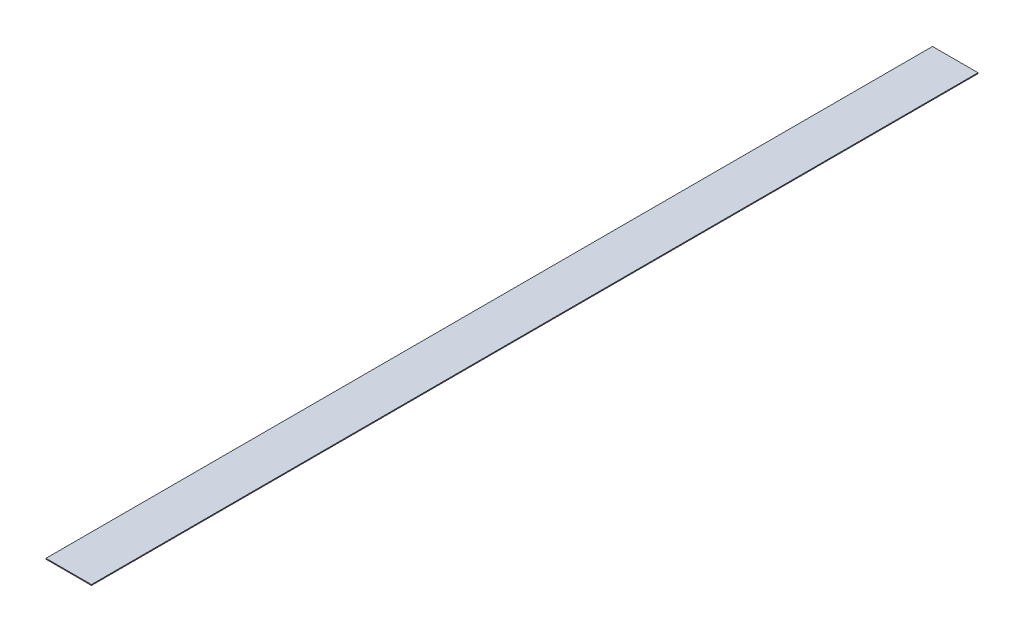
ISO-10303-21;
HEADER;
FILE_DESCRIPTION(('STEP AP214'),'2;1');
FILE_NAME('part.step','',(''),(''),'','','');
FILE_SCHEMA(('AUTOMOTIVE_DESIGN { 1 0 10303 214 1 1 1 1 }'));
ENDSEC;
DATA;
#1=APPLICATION_CONTEXT('core data for automotive mechanical design processes');
#2=APPLICATION_PROTOCOL_DEFINITION('international standard','automotive_design',2000,#1);
#3=PRODUCT_CONTEXT('',#1,'mechanical');
#4=PRODUCT('Part','Part','',(#3));
#5=PRODUCT_RELATED_PRODUCT_CATEGORY('part','',(#4));
#6=PRODUCT_DEFINITION_FORMATION('','',#4);
#7=PRODUCT_DEFINITION_CONTEXT('part definition',#1,'design');
#8=PRODUCT_DEFINITION('design','',#6,#7);
#9=PRODUCT_DEFINITION_SHAPE('','',#8);
#10=(LENGTH_UNIT() NAMED_UNIT(*) SI_UNIT(.MILLI.,.METRE.));
#11=(NAMED_UNIT(*) PLANE_ANGLE_UNIT() SI_UNIT($,.RADIAN.));
#12=(NAMED_UNIT(*) SI_UNIT($,.STERADIAN.) SOLID_ANGLE_UNIT());
#13=UNCERTAINTY_MEASURE_WITH_UNIT(LENGTH_MEASURE(1.E-05),#10,'distance_accuracy_value','');
#14=(GEOMETRIC_REPRESENTATION_CONTEXT(3) GLOBAL_UNCERTAINTY_ASSIGNED_CONTEXT((#13)) GLOBAL_UNIT_ASSIGNED_CONTEXT((#10,
#11,#12)) REPRESENTATION_CONTEXT('',''));
#15=CARTESIAN_POINT('',(0.,0.,0.));
#16=DIRECTION('',(0.,0.,1.));
#17=DIRECTION('',(1.,0.,0.));
#18=AXIS2_PLACEMENT_3D('',#15,#16,#17);
#19=CARTESIAN_POINT('',(0.,1.5,0.));
#20=DIRECTION('',(1.,0.,0.));
#21=DIRECTION('',(0.,0.,-1.));
#22=AXIS2_PLACEMENT_3D('',#19,#20,#21);
#23=PLANE('',#22);
#24=DIRECTION('',(0.,0.,1.));
#25=VECTOR('',#24,1.);
#26=CARTESIAN_POINT('',(0.,0.,0.));
#27=LINE('',#26,#25);
#28=CARTESIAN_POINT('',(0.,0.,-1520.));
#29=VERTEX_POINT('',#28);
#30=CARTESIAN_POINT('',(0.,0.,0.));
#31=VERTEX_POINT('',#30);
#32=EDGE_CURVE('E104',#29,#31,#27,.T.);
#33=ORIENTED_EDGE('',*,*,#32,.T.);
#34=DIRECTION('',(0.,-1.,0.));
#35=VECTOR('',#34,1.);
#36=CARTESIAN_POINT('',(0.,1.5,0.));
#37=LINE('',#36,#35);
#38=CARTESIAN_POINT('',(0.,1.5,0.));
#39=VERTEX_POINT('',#38);
#40=EDGE_CURVE('E11',#39,#31,#37,.T.);
#41=ORIENTED_EDGE('',*,*,#40,.F.);
#42=DIRECTION('',(0.,0.,1.));
#43=VECTOR('',#42,1.);
#44=CARTESIAN_POINT('',(0.,1.5,0.));
#45=LINE('',#44,#43);
#46=CARTESIAN_POINT('',(0.,1.5,-1520.));
#47=VERTEX_POINT('',#46);
#48=EDGE_CURVE('E92',#47,#39,#45,.T.);
#49=ORIENTED_EDGE('',*,*,#48,.F.);
#50=DIRECTION('',(0.,-1.,0.));
#51=VECTOR('',#50,1.);
#52=CARTESIAN_POINT('',(0.,1.5,-1520.));
#53=LINE('',#52,#51);
#54=EDGE_CURVE('E100',#47,#29,#53,.T.);
#55=ORIENTED_EDGE('',*,*,#54,.T.);
#56=EDGE_LOOP('',(#33,#41,#49,#55));
#57=FACE_BOUND('',#56,.T.);
#58=ADVANCED_FACE('F41',(#57),#23,.F.);
#59=CARTESIAN_POINT('',(0.,1.5,0.));
#60=DIRECTION('',(0.,0.,-1.));
#61=DIRECTION('',(-1.,0.,0.));
#62=AXIS2_PLACEMENT_3D('',#59,#60,#61);
#63=PLANE('',#62);
#64=DIRECTION('',(1.,0.,0.));
#65=VECTOR('',#64,1.);
#66=CARTESIAN_POINT('',(0.,0.,0.));
#67=LINE('',#66,#65);
#68=CARTESIAN_POINT('',(78.,0.,0.));
#69=VERTEX_POINT('',#68);
#70=EDGE_CURVE('E96',#31,#69,#67,.T.);
#71=ORIENTED_EDGE('',*,*,#70,.T.);
#72=DIRECTION('',(0.,-1.,0.));
#73=VECTOR('',#72,1.);
#74=CARTESIAN_POINT('',(78.,1.5,0.));
#75=LINE('',#74,#73);
#76=CARTESIAN_POINT('',(78.,1.5,0.));
#77=VERTEX_POINT('',#76);
#78=EDGE_CURVE('E49',#77,#69,#75,.T.);
#79=ORIENTED_EDGE('',*,*,#78,.F.);
#80=DIRECTION('',(1.,0.,0.));
#81=VECTOR('',#80,1.);
#82=CARTESIAN_POINT('',(0.,1.5,0.));
#83=LINE('',#82,#81);
#84=EDGE_CURVE('E87',#39,#77,#83,.T.);
#85=ORIENTED_EDGE('',*,*,#84,.F.);
#86=ORIENTED_EDGE('',*,*,#40,.T.);
#87=EDGE_LOOP('',(#71,#79,#85,#86));
#88=FACE_BOUND('',#87,.T.);
#89=ADVANCED_FACE('F95',(#88),#63,.F.);
#90=CARTESIAN_POINT('',(78.,1.5,0.));
#91=DIRECTION('',(-1.,0.,0.));
#92=DIRECTION('',(0.,0.,1.));
#93=AXIS2_PLACEMENT_3D('',#90,#91,#92);
#94=PLANE('',#93);
#95=DIRECTION('',(0.,0.,-1.));
#96=VECTOR('',#95,1.);
#97=CARTESIAN_POINT('',(78.,0.,0.));
#98=LINE('',#97,#96);
#99=CARTESIAN_POINT('',(78.,0.,-1520.));
#100=VERTEX_POINT('',#99);
#101=EDGE_CURVE('E74',#69,#100,#98,.T.);
#102=ORIENTED_EDGE('',*,*,#101,.T.);
#103=DIRECTION('',(0.,-1.,0.));
#104=VECTOR('',#103,1.);
#105=CARTESIAN_POINT('',(78.,1.5,-1520.));
#106=LINE('',#105,#104);
#107=CARTESIAN_POINT('',(78.,1.5,-1520.));
#108=VERTEX_POINT('',#107);
#109=EDGE_CURVE('E97',#108,#100,#106,.T.);
#110=ORIENTED_EDGE('',*,*,#109,.F.);
#111=DIRECTION('',(0.,0.,-1.));
#112=VECTOR('',#111,1.);
#113=CARTESIAN_POINT('',(78.,1.5,0.));
#114=LINE('',#113,#112);
#115=EDGE_CURVE('E90',#77,#108,#114,.T.);
#116=ORIENTED_EDGE('',*,*,#115,.F.);
#117=ORIENTED_EDGE('',*,*,#78,.T.);
#118=EDGE_LOOP('',(#102,#110,#116,#117));
#119=FACE_BOUND('',#118,.T.);
#120=ADVANCED_FACE('F98',(#119),#94,.F.);
#121=CARTESIAN_POINT('',(0.,1.5,-1520.));
#122=DIRECTION('',(0.,0.,1.));
#123=DIRECTION('',(1.,0.,0.));
#124=AXIS2_PLACEMENT_3D('',#121,#122,#123);
#125=PLANE('',#124);
#126=DIRECTION('',(-1.,0.,0.));
#127=VECTOR('',#126,1.);
#128=CARTESIAN_POINT('',(0.,0.,-1520.));
#129=LINE('',#128,#127);
#130=EDGE_CURVE('E80',#100,#29,#129,.T.);
#131=ORIENTED_EDGE('',*,*,#130,.T.);
#132=ORIENTED_EDGE('',*,*,#54,.F.);
#133=DIRECTION('',(-1.,0.,0.));
#134=VECTOR('',#133,1.);
#135=CARTESIAN_POINT('',(0.,1.5,-1520.));
#136=LINE('',#135,#134);
#137=EDGE_CURVE('E57',#108,#47,#136,.T.);
#138=ORIENTED_EDGE('',*,*,#137,.F.);
#139=ORIENTED_EDGE('',*,*,#109,.T.);
#140=EDGE_LOOP('',(#131,#132,#138,#139));
#141=FACE_BOUND('',#140,.T.);
#142=ADVANCED_FACE('F111',(#141),#125,.F.);
#143=CARTESIAN_POINT('',(0.,1.5,0.));
#144=DIRECTION('',(0.,-1.,0.));
#145=DIRECTION('',(0.,0.,-1.));
#146=AXIS2_PLACEMENT_3D('',#143,#144,#145);
#147=PLANE('',#146);
#148=ORIENTED_EDGE('',*,*,#48,.T.);
#149=ORIENTED_EDGE('',*,*,#84,.T.);
#150=ORIENTED_EDGE('',*,*,#115,.T.);
#151=ORIENTED_EDGE('',*,*,#137,.T.);
#152=EDGE_LOOP('',(#148,#149,#150,#151));
#153=FACE_BOUND('',#152,.T.);
#154=ADVANCED_FACE('F88',(#153),#147,.F.);
#155=CARTESIAN_POINT('',(0.,0.,0.));
#156=DIRECTION('',(0.,-1.,0.));
#157=DIRECTION('',(0.,0.,-1.));
#158=AXIS2_PLACEMENT_3D('',#155,#156,#157);
#159=PLANE('',#158);
#160=ORIENTED_EDGE('',*,*,#32,.F.);
#161=ORIENTED_EDGE('',*,*,#130,.F.);
#162=ORIENTED_EDGE('',*,*,#101,.F.);
#163=ORIENTED_EDGE('',*,*,#70,.F.);
#164=EDGE_LOOP('',(#160,#161,#162,#163));
#165=FACE_BOUND('',#164,.T.);
#166=ADVANCED_FACE('F114',(#165),#159,.T.);
#167=CLOSED_SHELL('',(#58,#89,#120,#142,#154,#166));
#168=MANIFOLD_SOLID_BREP('B2',#167);
#169=ADVANCED_BREP_SHAPE_REPRESENTATION('',(#18,#168),#14);
#170=SHAPE_DEFINITION_REPRESENTATION(#9,#169);
ENDSEC;
END-ISO-10303-21;
